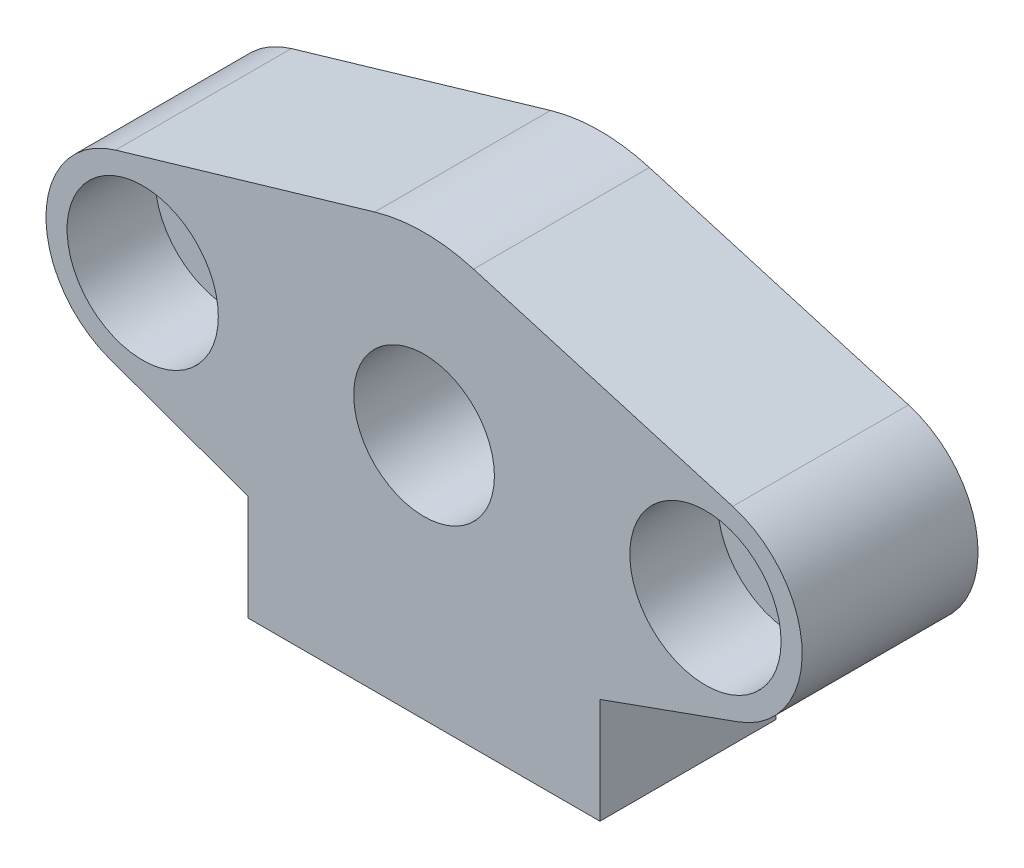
from build123d import *

# Parameters (mm, degrees)
SKETCH_1_R          = 4
SKETCH_1_R_2        = 2.5
EXTRUDE_1_DEPTH     = 10
SKETCH_2_R          = 4.3
CUT_EXTRUDE_1_DEPTH = 5


with BuildPart() as part:
    # Sketch 1 → Extrude 1 (new body)
    with BuildSketch(Plane.XY):
        with BuildLine():
            Line((-10, -14), (-10, -8))
            Line((-10, -8), (-17.859724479, -5.17604336))
            ThreePointArc((-17.859724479, -5.17604336), (-21.497538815, 0.16452044), (-17.546875, 5.277989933))
            Line((-17.546875, 5.277989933), (-2.8125, 9.596345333))
            ThreePointArc((-2.8125, 9.596345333), (0, 10), (2.8125, 9.596345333))
            Line((2.8125, 9.596345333), (17.546875, 5.277989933))
            ThreePointArc((17.546875, 5.277989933), (21.497538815, 0.16452044), (17.859724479, -5.17604336))
            Line((17.859724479, -5.17604336), (10, -8))
            Line((10, -8), (10, -14))
            Line((10, -14), (-10, -14))
        make_face()
        Circle(SKETCH_1_R, mode=Mode.SUBTRACT)
        with Locations((-16, 0)):
            Circle(SKETCH_1_R_2, mode=Mode.SUBTRACT)
        with Locations(Location((16, 0, 0), (0, 0, 180))):
            Circle(SKETCH_1_R_2, mode=Mode.SUBTRACT)
    extrude(amount=EXTRUDE_1_DEPTH)

    # Sketch 2 → Cut-Extrude 1 (cut)
    with BuildSketch(Plane.XY.offset(10)):
        with Locations((-16, 0)):
            Circle(SKETCH_2_R)
        with Locations((16, 0)):
            Circle(SKETCH_2_R)
    extrude(amount=-CUT_EXTRUDE_1_DEPTH, mode=Mode.SUBTRACT)


solid = part.part
